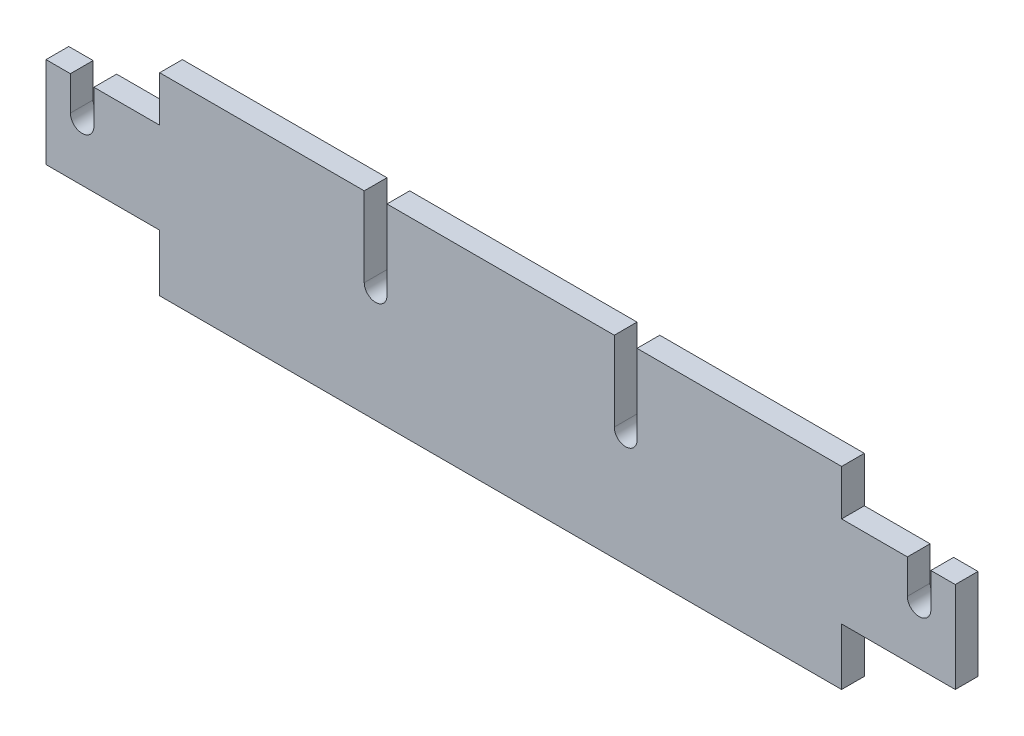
from build123d import *

# Parameters (mm, degrees)
RESSALTO_EXTRUS_O1_DEPTH = 2


with BuildPart() as part:
    # Esbo_o1 → Ressalto-extrus_o1 (new body)
    with BuildSketch(Plane.XY):
        with BuildLine():
            Line((-30, 5), (-30, 0))
            Line((-30, 0), (30, 0))
            Line((30, 0), (30, 5))
            Line((30, 5), (40, 5))
            Line((40, 5), (40, 13))
            Line((40, 13), (37.853679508, 13))
            Line((37.853679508, 13), (37.853679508, 10))
            ThreePointArc((37.853679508, 10), (36.820223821, 8.966544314), (35.786768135, 10))
            Line((35.786768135, 10), (35.786768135, 13))
            Line((35.786768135, 13), (30, 13))
            Line((30, 13), (30, 17))
            Line((30, 17), (12, 17))
            Line((12, 17), (12, 10))
            ThreePointArc((12, 10), (11, 9), (10, 10))
            Line((10, 10), (10, 17))
            Line((10, 17), (-10, 17))
            Line((-10, 17), (-10, 10))
            ThreePointArc((-10, 10), (-11, 9), (-12, 10))
            Line((-12, 10), (-12, 17))
            Line((-12, 17), (-30, 17))
            Line((-30, 17), (-30, 13))
            Line((-30, 13), (-35.786768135, 13))
            Line((-35.786768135, 13), (-35.786768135, 10))
            ThreePointArc((-35.786768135, 10), (-36.820223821, 8.966544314), (-37.853679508, 10))
            Line((-37.853679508, 10), (-37.853679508, 13))
            Line((-37.853679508, 13), (-40, 13))
            Line((-40, 13), (-40, 5))
            Line((-40, 5), (-30, 5))
        make_face()
    extrude(amount=RESSALTO_EXTRUS_O1_DEPTH)


solid = part.part
